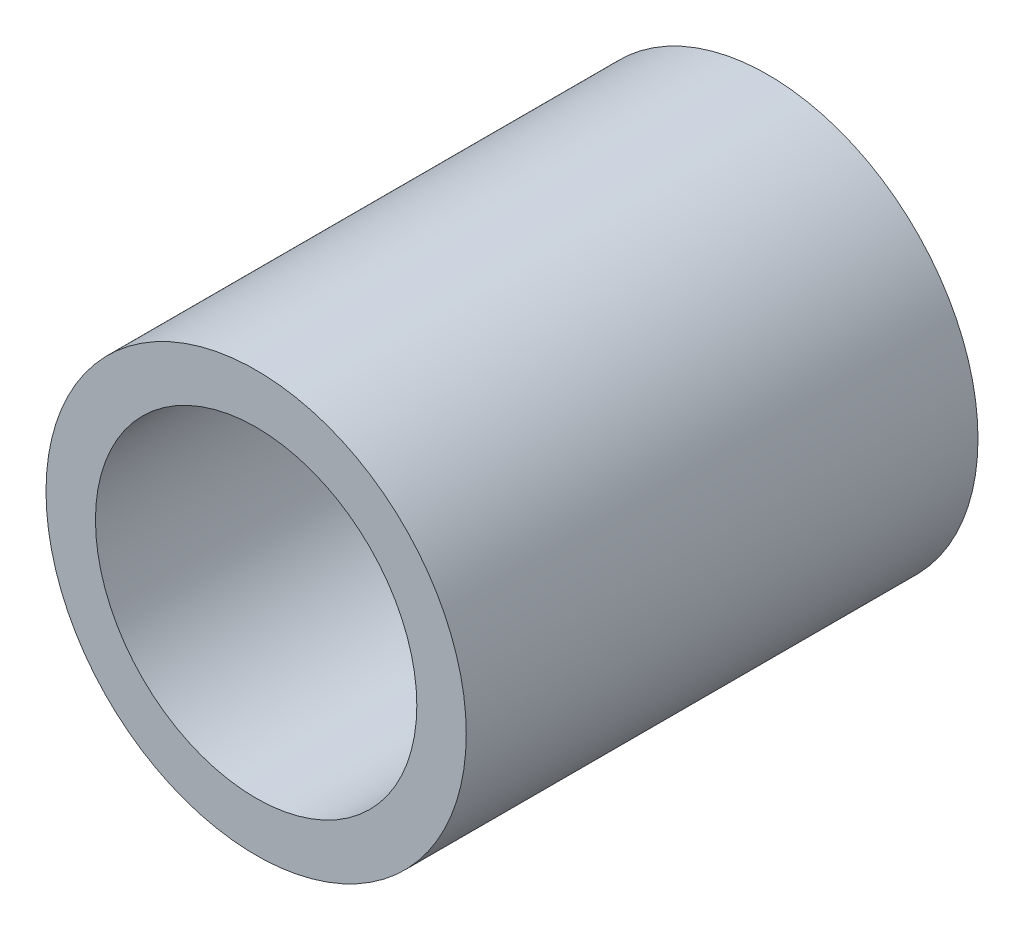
ISO-10303-21;
HEADER;
FILE_DESCRIPTION(('STEP AP214'),'2;1');
FILE_NAME('part.step','',(''),(''),'','','');
FILE_SCHEMA(('AUTOMOTIVE_DESIGN { 1 0 10303 214 1 1 1 1 }'));
ENDSEC;
DATA;
#1=APPLICATION_CONTEXT('core data for automotive mechanical design processes');
#2=APPLICATION_PROTOCOL_DEFINITION('international standard','automotive_design',2000,#1);
#3=PRODUCT_CONTEXT('',#1,'mechanical');
#4=PRODUCT('Part','Part','',(#3));
#5=PRODUCT_RELATED_PRODUCT_CATEGORY('part','',(#4));
#6=PRODUCT_DEFINITION_FORMATION('','',#4);
#7=PRODUCT_DEFINITION_CONTEXT('part definition',#1,'design');
#8=PRODUCT_DEFINITION('design','',#6,#7);
#9=PRODUCT_DEFINITION_SHAPE('','',#8);
#10=(LENGTH_UNIT() NAMED_UNIT(*) SI_UNIT(.MILLI.,.METRE.));
#11=(NAMED_UNIT(*) PLANE_ANGLE_UNIT() SI_UNIT($,.RADIAN.));
#12=(NAMED_UNIT(*) SI_UNIT($,.STERADIAN.) SOLID_ANGLE_UNIT());
#13=UNCERTAINTY_MEASURE_WITH_UNIT(LENGTH_MEASURE(1.E-05),#10,'distance_accuracy_value','');
#14=(GEOMETRIC_REPRESENTATION_CONTEXT(3) GLOBAL_UNCERTAINTY_ASSIGNED_CONTEXT((#13)) GLOBAL_UNIT_ASSIGNED_CONTEXT((#10,
#11,#12)) REPRESENTATION_CONTEXT('',''));
#15=CARTESIAN_POINT('',(0.,0.,0.));
#16=DIRECTION('',(0.,0.,1.));
#17=DIRECTION('',(1.,0.,0.));
#18=AXIS2_PLACEMENT_3D('',#15,#16,#17);
#19=CARTESIAN_POINT('',(0.,0.,20.7));
#20=DIRECTION('',(0.,0.,1.));
#21=DIRECTION('',(1.,0.,0.));
#22=AXIS2_PLACEMENT_3D('',#19,#20,#21);
#23=PLANE('',#22);
#24=CARTESIAN_POINT('',(0.,0.,20.7));
#25=DIRECTION('',(0.,0.,1.));
#26=DIRECTION('',(1.,0.,0.));
#27=AXIS2_PLACEMENT_3D('',#24,#25,#26);
#28=CIRCLE('',#27,8.5);
#29=CARTESIAN_POINT('',(8.5,0.,20.7));
#30=VERTEX_POINT('',#29);
#31=EDGE_CURVE('E10',#30,#30,#28,.T.);
#32=ORIENTED_EDGE('',*,*,#31,.T.);
#33=EDGE_LOOP('',(#32));
#34=FACE_BOUND('',#33,.T.);
#35=CARTESIAN_POINT('',(0.,0.,20.7));
#36=DIRECTION('',(0.,0.,1.));
#37=DIRECTION('',(1.,0.,0.));
#38=AXIS2_PLACEMENT_3D('',#35,#36,#37);
#39=CIRCLE('',#38,6.5);
#40=CARTESIAN_POINT('',(6.5,0.,20.7));
#41=VERTEX_POINT('',#40);
#42=EDGE_CURVE('E38',#41,#41,#39,.T.);
#43=ORIENTED_EDGE('',*,*,#42,.F.);
#44=EDGE_LOOP('',(#43));
#45=FACE_BOUND('',#44,.T.);
#46=ADVANCED_FACE('F27',(#34,#45),#23,.T.);
#47=CARTESIAN_POINT('',(0.,0.,0.));
#48=DIRECTION('',(0.,0.,1.));
#49=DIRECTION('',(1.,0.,0.));
#50=AXIS2_PLACEMENT_3D('',#47,#48,#49);
#51=PLANE('',#50);
#52=CARTESIAN_POINT('',(0.,0.,0.));
#53=DIRECTION('',(0.,0.,1.));
#54=DIRECTION('',(1.,0.,0.));
#55=AXIS2_PLACEMENT_3D('',#52,#53,#54);
#56=CIRCLE('',#55,8.5);
#57=CARTESIAN_POINT('',(8.5,0.,0.));
#58=VERTEX_POINT('',#57);
#59=EDGE_CURVE('E34',#58,#58,#56,.T.);
#60=ORIENTED_EDGE('',*,*,#59,.F.);
#61=EDGE_LOOP('',(#60));
#62=FACE_BOUND('',#61,.T.);
#63=CARTESIAN_POINT('',(0.,0.,0.));
#64=DIRECTION('',(0.,0.,1.));
#65=DIRECTION('',(1.,0.,0.));
#66=AXIS2_PLACEMENT_3D('',#63,#64,#65);
#67=CIRCLE('',#66,6.5);
#68=CARTESIAN_POINT('',(6.5,0.,0.));
#69=VERTEX_POINT('',#68);
#70=EDGE_CURVE('E42',#69,#69,#67,.T.);
#71=ORIENTED_EDGE('',*,*,#70,.T.);
#72=EDGE_LOOP('',(#71));
#73=FACE_BOUND('',#72,.T.);
#74=ADVANCED_FACE('F48',(#62,#73),#51,.F.);
#75=CARTESIAN_POINT('',(0.,0.,20.7));
#76=DIRECTION('',(0.,0.,-1.));
#77=DIRECTION('',(-1.,0.,0.));
#78=AXIS2_PLACEMENT_3D('',#75,#76,#77);
#79=CYLINDRICAL_SURFACE('',#78,8.5);
#80=ORIENTED_EDGE('',*,*,#31,.F.);
#81=EDGE_LOOP('',(#80));
#82=FACE_BOUND('',#81,.T.);
#83=ORIENTED_EDGE('',*,*,#59,.T.);
#84=EDGE_LOOP('',(#83));
#85=FACE_BOUND('',#84,.T.);
#86=ADVANCED_FACE('F29',(#82,#85),#79,.T.);
#87=CARTESIAN_POINT('',(0.,0.,20.7));
#88=DIRECTION('',(0.,0.,-1.));
#89=DIRECTION('',(-1.,0.,0.));
#90=AXIS2_PLACEMENT_3D('',#87,#88,#89);
#91=CYLINDRICAL_SURFACE('',#90,6.5);
#92=ORIENTED_EDGE('',*,*,#42,.T.);
#93=EDGE_LOOP('',(#92));
#94=FACE_BOUND('',#93,.T.);
#95=ORIENTED_EDGE('',*,*,#70,.F.);
#96=EDGE_LOOP('',(#95));
#97=FACE_BOUND('',#96,.T.);
#98=ADVANCED_FACE('F50',(#94,#97),#91,.F.);
#99=CLOSED_SHELL('',(#46,#74,#86,#98));
#100=MANIFOLD_SOLID_BREP('B2',#99);
#101=ADVANCED_BREP_SHAPE_REPRESENTATION('',(#18,#100),#14);
#102=SHAPE_DEFINITION_REPRESENTATION(#9,#101);
ENDSEC;
END-ISO-10303-21;
